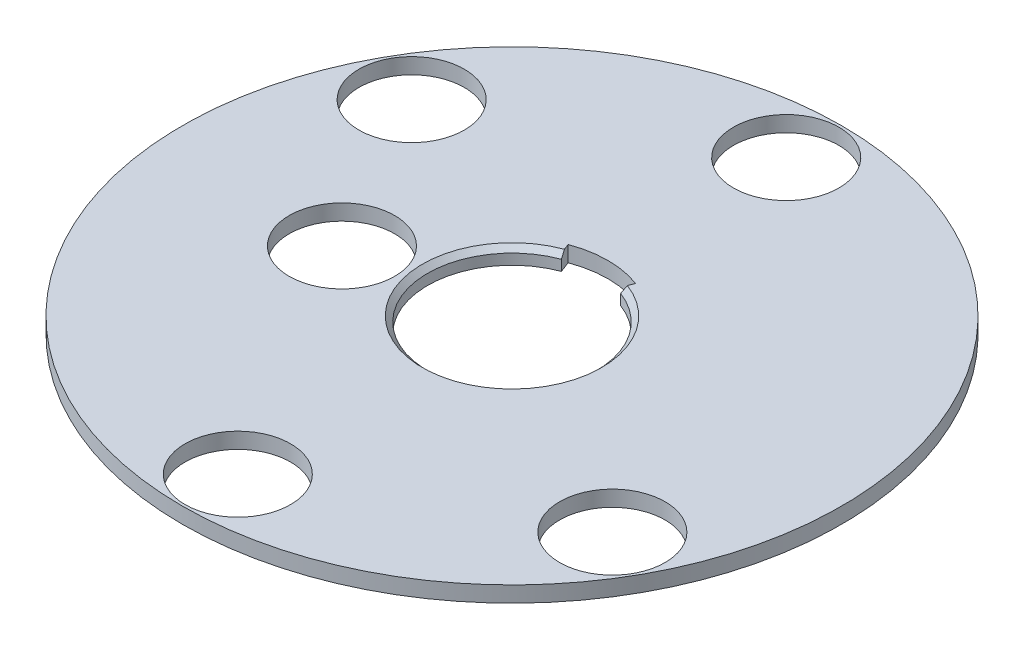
from build123d import *

# Parameters (mm, degrees)
SKETCH1_R           = 31.25
BOSS_EXTRUDE1_DEPTH = 1.5
CHAMFER1_SIZE       = 0.5
SKETCH2_R           = 5
CUT_EXTRUDE1_DEPTH  = 10


with BuildPart() as part:
    # Sketch1 → Boss-Extrude1 (new body)
    with BuildSketch(Plane(origin=(0, 0, 0), x_dir=(1, 0, 0), z_dir=(0, 1, 0))):
        with Locations(Location((0, 0, 0), (0, 0, 270))):
            Circle(SKETCH1_R)
        with BuildLine():
            Line((2.808987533, 7.490633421), (3, 8))
            Line((3, 8), (3.195223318, 8.520595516))
            ThreePointArc((3.195223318, 8.520595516), (0, 9.1), (-3.195223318, 8.520595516))
            Line((-3.195223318, 8.520595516), (-3, 8))
            Line((-3, 8), (-2.808987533, 7.490633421))
            ThreePointArc((-2.808987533, 7.490633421), (0, -8), (2.808987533, 7.490633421))
        make_face(mode=Mode.SUBTRACT)
    extrude(amount=-BOSS_EXTRUDE1_DEPTH)

    # Chamfer1
    chamfer1_edges = [part.edges().sort_by_distance(p)[0] for p in [
        (0, 0, 8),
    ]]
    chamfer(chamfer1_edges, length=CHAMFER1_SIZE)

    # Sketch2 → Cut-Extrude1 (cut)
    with BuildSketch(Plane(origin=(0, 0, 0), x_dir=(1, 0, 0), z_dir=(0, 1, 0))):
        with Locations(Location((0, 26, 0), (0, 0, 270))):
            Circle(SKETCH2_R)
        with Locations(Location((22.516660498, -13, 0), (0, 0, 270))):
            Circle(SKETCH2_R)
        with Locations(Location((0, -26, 0), (0, 0, 270))):
            Circle(SKETCH2_R)
        with Locations(Location((-22.516660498, 13, 0), (0, 0, 270))):
            Circle(SKETCH2_R)
        with Locations(Location((-13.806381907, -2.32030572, 0), (0, 0, 270))):
            Circle(SKETCH2_R)
    extrude(amount=-CUT_EXTRUDE1_DEPTH, mode=Mode.SUBTRACT)


solid = part.part
